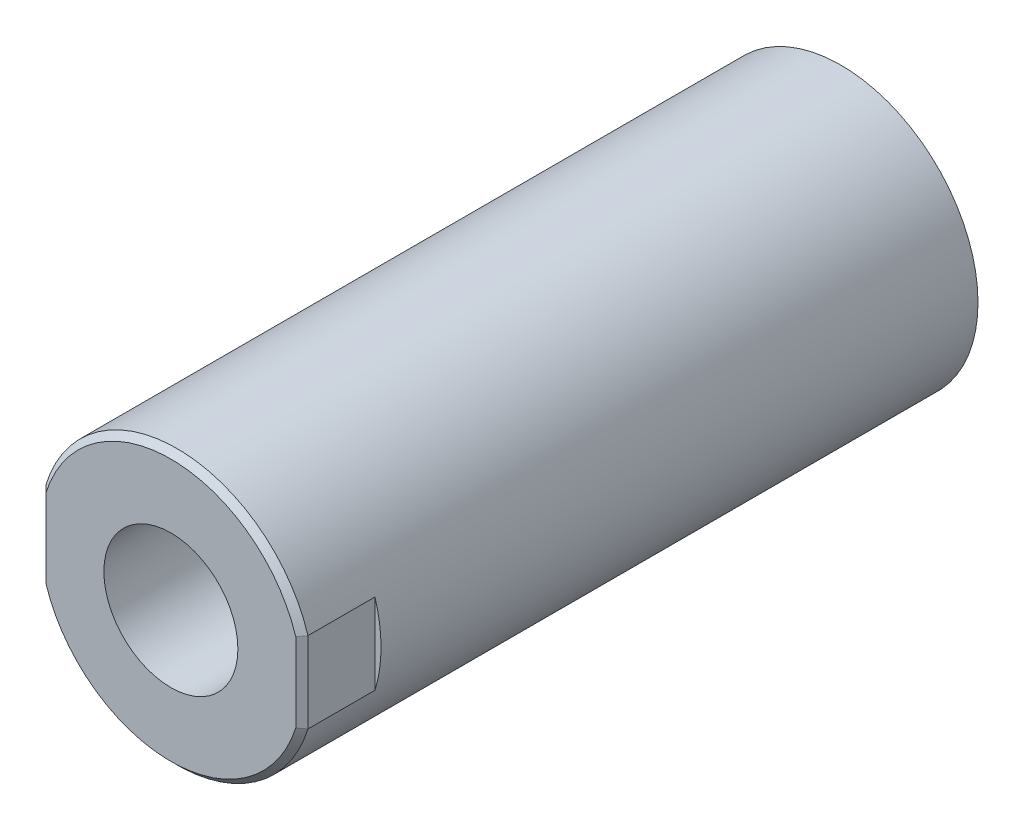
ISO-10303-21;
HEADER;
FILE_DESCRIPTION(('STEP AP214'),'2;1');
FILE_NAME('part.step','',(''),(''),'','','');
FILE_SCHEMA(('AUTOMOTIVE_DESIGN { 1 0 10303 214 1 1 1 1 }'));
ENDSEC;
DATA;
#1=APPLICATION_CONTEXT('core data for automotive mechanical design processes');
#2=APPLICATION_PROTOCOL_DEFINITION('international standard','automotive_design',2000,#1);
#3=PRODUCT_CONTEXT('',#1,'mechanical');
#4=PRODUCT('Part','Part','',(#3));
#5=PRODUCT_RELATED_PRODUCT_CATEGORY('part','',(#4));
#6=PRODUCT_DEFINITION_FORMATION('','',#4);
#7=PRODUCT_DEFINITION_CONTEXT('part definition',#1,'design');
#8=PRODUCT_DEFINITION('design','',#6,#7);
#9=PRODUCT_DEFINITION_SHAPE('','',#8);
#10=(LENGTH_UNIT() NAMED_UNIT(*) SI_UNIT(.MILLI.,.METRE.));
#11=(NAMED_UNIT(*) PLANE_ANGLE_UNIT() SI_UNIT($,.RADIAN.));
#12=(NAMED_UNIT(*) SI_UNIT($,.STERADIAN.) SOLID_ANGLE_UNIT());
#13=UNCERTAINTY_MEASURE_WITH_UNIT(LENGTH_MEASURE(1.E-05),#10,'distance_accuracy_value','');
#14=(GEOMETRIC_REPRESENTATION_CONTEXT(3) GLOBAL_UNCERTAINTY_ASSIGNED_CONTEXT((#13)) GLOBAL_UNIT_ASSIGNED_CONTEXT((#10,
#11,#12)) REPRESENTATION_CONTEXT('',''));
#15=CARTESIAN_POINT('',(0.,0.,0.));
#16=DIRECTION('',(0.,0.,1.));
#17=DIRECTION('',(1.,0.,0.));
#18=AXIS2_PLACEMENT_3D('',#15,#16,#17);
#19=CARTESIAN_POINT('',(0.,0.,-110.));
#20=DIRECTION('',(0.,0.,1.));
#21=DIRECTION('',(1.,0.,0.));
#22=AXIS2_PLACEMENT_3D('',#19,#20,#21);
#23=PLANE('',#22);
#24=CARTESIAN_POINT('',(0.,0.,-110.));
#25=DIRECTION('',(0.,0.,1.));
#26=DIRECTION('',(1.,0.,0.));
#27=AXIS2_PLACEMENT_3D('',#24,#25,#26);
#28=CIRCLE('',#27,22.5);
#29=CARTESIAN_POINT('',(22.5,0.,-110.));
#30=VERTEX_POINT('',#29);
#31=EDGE_CURVE('E210',#30,#30,#28,.T.);
#32=ORIENTED_EDGE('',*,*,#31,.F.);
#33=EDGE_LOOP('',(#32));
#34=FACE_BOUND('',#33,.T.);
#35=ADVANCED_FACE('F39',(#34),#23,.F.);
#36=CARTESIAN_POINT('',(21.5,-10.5,-12.));
#37=DIRECTION('',(0.,0.,-1.));
#38=DIRECTION('',(-1.,0.,0.));
#39=AXIS2_PLACEMENT_3D('',#36,#37,#38);
#40=PLANE('',#39);
#41=CARTESIAN_POINT('',(0.,0.,-12.));
#42=DIRECTION('',(0.,0.,-1.));
#43=DIRECTION('',(-1.,0.,0.));
#44=AXIS2_PLACEMENT_3D('',#41,#42,#43);
#45=CIRCLE('',#44,22.5);
#46=CARTESIAN_POINT('',(21.5,-6.63324958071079,-12.));
#47=VERTEX_POINT('',#46);
#48=CARTESIAN_POINT('',(21.5,6.63324958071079,-12.));
#49=VERTEX_POINT('',#48);
#50=EDGE_CURVE('E213',#47,#49,#45,.F.);
#51=ORIENTED_EDGE('',*,*,#50,.T.);
#52=DIRECTION('',(0.,1.,0.));
#53=VECTOR('',#52,1.);
#54=CARTESIAN_POINT('',(21.5,-10.5,-12.));
#55=LINE('',#54,#53);
#56=EDGE_CURVE('E113',#47,#49,#55,.T.);
#57=ORIENTED_EDGE('',*,*,#56,.F.);
#58=EDGE_LOOP('',(#51,#57));
#59=FACE_BOUND('',#58,.T.);
#60=ADVANCED_FACE('F170',(#59),#40,.F.);
#61=CARTESIAN_POINT('',(-24.,-10.5,-12.));
#62=DIRECTION('',(0.,0.,-1.));
#63=DIRECTION('',(-1.,0.,0.));
#64=AXIS2_PLACEMENT_3D('',#61,#62,#63);
#65=PLANE('',#64);
#66=CARTESIAN_POINT('',(0.,0.,-12.));
#67=DIRECTION('',(0.,0.,-1.));
#68=DIRECTION('',(-1.,0.,0.));
#69=AXIS2_PLACEMENT_3D('',#66,#67,#68);
#70=CIRCLE('',#69,22.5);
#71=CARTESIAN_POINT('',(-21.5,6.63324958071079,-12.));
#72=VERTEX_POINT('',#71);
#73=CARTESIAN_POINT('',(-21.5,-6.63324958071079,-12.));
#74=VERTEX_POINT('',#73);
#75=EDGE_CURVE('E108',#72,#74,#70,.F.);
#76=ORIENTED_EDGE('',*,*,#75,.T.);
#77=DIRECTION('',(0.,1.,0.));
#78=VECTOR('',#77,1.);
#79=CARTESIAN_POINT('',(-21.5,-10.5,-12.));
#80=LINE('',#79,#78);
#81=EDGE_CURVE('E103',#74,#72,#80,.T.);
#82=ORIENTED_EDGE('',*,*,#81,.T.);
#83=EDGE_LOOP('',(#76,#82));
#84=FACE_BOUND('',#83,.T.);
#85=ADVANCED_FACE('F111',(#84),#65,.F.);
#86=CARTESIAN_POINT('',(0.,0.,-110.));
#87=DIRECTION('',(0.,0.,1.));
#88=DIRECTION('',(1.,0.,0.));
#89=AXIS2_PLACEMENT_3D('',#86,#87,#88);
#90=CYLINDRICAL_SURFACE('',#89,22.5);
#91=DIRECTION('',(0.,0.,1.));
#92=VECTOR('',#91,1.);
#93=CARTESIAN_POINT('',(-21.5,6.63324958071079,-110.));
#94=LINE('',#93,#92);
#95=CARTESIAN_POINT('',(-21.5,6.63324958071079,-1.));
#96=VERTEX_POINT('',#95);
#97=EDGE_CURVE('E99',#96,#72,#94,.F.);
#98=ORIENTED_EDGE('',*,*,#97,.F.);
#99=CARTESIAN_POINT('',(0.,0.,-1.));
#100=DIRECTION('',(0.,0.,1.));
#101=DIRECTION('',(1.,0.,0.));
#102=AXIS2_PLACEMENT_3D('',#99,#100,#101);
#103=CIRCLE('',#102,22.5);
#104=CARTESIAN_POINT('',(21.5,6.63324958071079,-1.));
#105=VERTEX_POINT('',#104);
#106=EDGE_CURVE('E52',#96,#105,#103,.F.);
#107=ORIENTED_EDGE('',*,*,#106,.T.);
#108=DIRECTION('',(0.,0.,1.));
#109=VECTOR('',#108,1.);
#110=CARTESIAN_POINT('',(21.5,6.63324958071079,-110.));
#111=LINE('',#110,#109);
#112=EDGE_CURVE('E219',#49,#105,#111,.T.);
#113=ORIENTED_EDGE('',*,*,#112,.F.);
#114=ORIENTED_EDGE('',*,*,#50,.F.);
#115=DIRECTION('',(0.,0.,1.));
#116=VECTOR('',#115,1.);
#117=CARTESIAN_POINT('',(21.5,-6.63324958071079,-110.));
#118=LINE('',#117,#116);
#119=CARTESIAN_POINT('',(21.5,-6.63324958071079,-1.));
#120=VERTEX_POINT('',#119);
#121=EDGE_CURVE('E120',#120,#47,#118,.F.);
#122=ORIENTED_EDGE('',*,*,#121,.F.);
#123=CARTESIAN_POINT('',(0.,0.,-1.));
#124=DIRECTION('',(0.,0.,1.));
#125=DIRECTION('',(1.,0.,0.));
#126=AXIS2_PLACEMENT_3D('',#123,#124,#125);
#127=CIRCLE('',#126,22.5);
#128=CARTESIAN_POINT('',(-21.5,-6.63324958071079,-1.));
#129=VERTEX_POINT('',#128);
#130=EDGE_CURVE('E134',#120,#129,#127,.F.);
#131=ORIENTED_EDGE('',*,*,#130,.T.);
#132=DIRECTION('',(0.,0.,1.));
#133=VECTOR('',#132,1.);
#134=CARTESIAN_POINT('',(-21.5,-6.63324958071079,-110.));
#135=LINE('',#134,#133);
#136=EDGE_CURVE('E118',#74,#129,#135,.T.);
#137=ORIENTED_EDGE('',*,*,#136,.F.);
#138=ORIENTED_EDGE('',*,*,#75,.F.);
#139=EDGE_LOOP('',(#98,#107,#113,#114,#122,#131,#137,#138));
#140=FACE_BOUND('',#139,.T.);
#141=ORIENTED_EDGE('',*,*,#31,.T.);
#142=EDGE_LOOP('',(#141));
#143=FACE_BOUND('',#142,.T.);
#144=ADVANCED_FACE('F116',(#140,#143),#90,.T.);
#145=CARTESIAN_POINT('',(21.5,-10.5,0.));
#146=DIRECTION('',(-1.,0.,0.));
#147=DIRECTION('',(0.,0.,1.));
#148=AXIS2_PLACEMENT_3D('',#145,#146,#147);
#149=PLANE('',#148);
#150=ORIENTED_EDGE('',*,*,#112,.T.);
#151=DIRECTION('',(0.,-1.,0.));
#152=VECTOR('',#151,1.);
#153=CARTESIAN_POINT('',(21.5,-6.63324958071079,-1.));
#154=LINE('',#153,#152);
#155=EDGE_CURVE('E11',#105,#120,#154,.T.);
#156=ORIENTED_EDGE('',*,*,#155,.T.);
#157=ORIENTED_EDGE('',*,*,#121,.T.);
#158=ORIENTED_EDGE('',*,*,#56,.T.);
#159=EDGE_LOOP('',(#150,#156,#157,#158));
#160=FACE_BOUND('',#159,.T.);
#161=ADVANCED_FACE('F183',(#160),#149,.F.);
#162=CARTESIAN_POINT('',(-21.5,-10.5,0.));
#163=DIRECTION('',(1.,0.,0.));
#164=DIRECTION('',(0.,0.,-1.));
#165=AXIS2_PLACEMENT_3D('',#162,#163,#164);
#166=PLANE('',#165);
#167=ORIENTED_EDGE('',*,*,#136,.T.);
#168=DIRECTION('',(0.,1.,0.));
#169=VECTOR('',#168,1.);
#170=CARTESIAN_POINT('',(-21.5,6.63324958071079,-1.));
#171=LINE('',#170,#169);
#172=EDGE_CURVE('E106',#129,#96,#171,.T.);
#173=ORIENTED_EDGE('',*,*,#172,.T.);
#174=ORIENTED_EDGE('',*,*,#97,.T.);
#175=ORIENTED_EDGE('',*,*,#81,.F.);
#176=EDGE_LOOP('',(#167,#173,#174,#175));
#177=FACE_BOUND('',#176,.T.);
#178=ADVANCED_FACE('F102',(#177),#166,.F.);
#179=CARTESIAN_POINT('',(0.,0.,0.));
#180=DIRECTION('',(0.,0.,1.));
#181=DIRECTION('',(1.,0.,0.));
#182=AXIS2_PLACEMENT_3D('',#179,#180,#181);
#183=PLANE('',#182);
#184=CARTESIAN_POINT('',(0.,0.,0.));
#185=DIRECTION('',(0.,0.,1.));
#186=DIRECTION('',(1.,0.,0.));
#187=AXIS2_PLACEMENT_3D('',#184,#185,#186);
#188=CIRCLE('',#187,21.5);
#189=CARTESIAN_POINT('',(20.5,6.48074069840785,0.));
#190=VERTEX_POINT('',#189);
#191=CARTESIAN_POINT('',(-20.5,6.48074069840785,0.));
#192=VERTEX_POINT('',#191);
#193=EDGE_CURVE('E129',#190,#192,#188,.T.);
#194=ORIENTED_EDGE('',*,*,#193,.T.);
#195=DIRECTION('',(0.,-1.,0.));
#196=VECTOR('',#195,1.);
#197=CARTESIAN_POINT('',(-20.5,-6.63324958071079,0.));
#198=LINE('',#197,#196);
#199=CARTESIAN_POINT('',(-20.5,-6.48074069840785,0.));
#200=VERTEX_POINT('',#199);
#201=EDGE_CURVE('E131',#192,#200,#198,.T.);
#202=ORIENTED_EDGE('',*,*,#201,.T.);
#203=CARTESIAN_POINT('',(0.,0.,0.));
#204=DIRECTION('',(0.,0.,1.));
#205=DIRECTION('',(1.,0.,0.));
#206=AXIS2_PLACEMENT_3D('',#203,#204,#205);
#207=CIRCLE('',#206,21.5);
#208=CARTESIAN_POINT('',(20.5,-6.48074069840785,0.));
#209=VERTEX_POINT('',#208);
#210=EDGE_CURVE('E125',#200,#209,#207,.T.);
#211=ORIENTED_EDGE('',*,*,#210,.T.);
#212=DIRECTION('',(0.,1.,0.));
#213=VECTOR('',#212,1.);
#214=CARTESIAN_POINT('',(20.5,6.63324958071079,0.));
#215=LINE('',#214,#213);
#216=EDGE_CURVE('E127',#209,#190,#215,.T.);
#217=ORIENTED_EDGE('',*,*,#216,.T.);
#218=EDGE_LOOP('',(#194,#202,#211,#217));
#219=FACE_BOUND('',#218,.T.);
#220=CARTESIAN_POINT('',(0.,0.,0.));
#221=DIRECTION('',(0.,0.,-1.));
#222=DIRECTION('',(-1.,0.,0.));
#223=AXIS2_PLACEMENT_3D('',#220,#221,#222);
#224=CIRCLE('',#223,11.);
#225=CARTESIAN_POINT('',(-11.,0.,0.));
#226=VERTEX_POINT('',#225);
#227=EDGE_CURVE('E114',#226,#226,#224,.F.);
#228=ORIENTED_EDGE('',*,*,#227,.F.);
#229=EDGE_LOOP('',(#228));
#230=FACE_BOUND('',#229,.T.);
#231=ADVANCED_FACE('F195',(#219,#230),#183,.T.);
#232=CARTESIAN_POINT('',(0.,0.,15.));
#233=DIRECTION('',(0.,0.,1.));
#234=DIRECTION('',(1.,0.,0.));
#235=AXIS2_PLACEMENT_3D('',#232,#233,#234);
#236=CYLINDRICAL_SURFACE('',#235,11.);
#237=ORIENTED_EDGE('',*,*,#227,.T.);
#238=EDGE_LOOP('',(#237));
#239=FACE_BOUND('',#238,.T.);
#240=CARTESIAN_POINT('',(0.,0.,-39.));
#241=DIRECTION('',(0.,0.,1.));
#242=DIRECTION('',(1.,0.,0.));
#243=AXIS2_PLACEMENT_3D('',#240,#241,#242);
#244=CIRCLE('',#243,11.);
#245=CARTESIAN_POINT('',(11.,0.,-39.));
#246=VERTEX_POINT('',#245);
#247=EDGE_CURVE('E208',#246,#246,#244,.T.);
#248=ORIENTED_EDGE('',*,*,#247,.F.);
#249=EDGE_LOOP('',(#248));
#250=FACE_BOUND('',#249,.T.);
#251=ADVANCED_FACE('F180',(#239,#250),#236,.F.);
#252=CARTESIAN_POINT('',(0.,0.,-39.));
#253=DIRECTION('',(0.,0.,1.));
#254=DIRECTION('',(1.,0.,0.));
#255=AXIS2_PLACEMENT_3D('',#252,#253,#254);
#256=CONICAL_SURFACE('',#255,11.,1.02974425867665);
#257=CARTESIAN_POINT('',(0.,0.,-45.6094668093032));
#258=VERTEX_POINT('',#257);
#259=VERTEX_LOOP('',#258);
#260=FACE_BOUND('',#259,.T.);
#261=ORIENTED_EDGE('',*,*,#247,.T.);
#262=EDGE_LOOP('',(#261));
#263=FACE_BOUND('',#262,.T.);
#264=ADVANCED_FACE('F166',(#260,#263),#256,.F.);
#265=CARTESIAN_POINT('',(20.5,0.,0.));
#266=DIRECTION('',(0.70710678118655,0.,0.707106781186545));
#267=DIRECTION('',(0.707106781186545,0.,-0.70710678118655));
#268=AXIS2_PLACEMENT_3D('',#265,#266,#267);
#269=PLANE('',#268);
#270=CARTESIAN_POINT('',(21.5,6.63324958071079,-1.));
#271=CARTESIAN_POINT('',(21.33331105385,6.60812362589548,-0.833311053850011));
#272=CARTESIAN_POINT('',(21.1666332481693,6.58285157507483,-0.666633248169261));
#273=CARTESIAN_POINT('',(20.8332999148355,6.53201528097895,-0.333299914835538));
#274=CARTESIAN_POINT('',(20.666644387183,6.50645103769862,-0.166644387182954));
#275=CARTESIAN_POINT('',(20.5,6.48074069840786,0.));
#276=B_SPLINE_CURVE_WITH_KNOTS('',3,(#270,#271,#272,#273,#274,#275),.UNSPECIFIED.,.F.,.F.,(4,2,
4),(0.,0.711206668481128,1.42241334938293),.UNSPECIFIED.);
#277=EDGE_CURVE('E226',#190,#105,#276,.F.);
#278=ORIENTED_EDGE('',*,*,#277,.F.);
#279=ORIENTED_EDGE('',*,*,#216,.F.);
#280=CARTESIAN_POINT('',(21.5,-6.63324958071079,-1.));
#281=CARTESIAN_POINT('',(21.33331105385,-6.60812362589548,-0.833311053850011));
#282=CARTESIAN_POINT('',(21.1666332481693,-6.58285157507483,-0.666633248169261));
#283=CARTESIAN_POINT('',(20.8332999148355,-6.53201528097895,-0.333299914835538));
#284=CARTESIAN_POINT('',(20.666644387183,-6.50645103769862,-0.166644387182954));
#285=CARTESIAN_POINT('',(20.5,-6.48074069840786,0.));
#286=B_SPLINE_CURVE_WITH_KNOTS('',3,(#280,#281,#282,#283,#284,#285),.UNSPECIFIED.,.F.,.F.,(4,2,
4),(0.,0.711206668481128,1.42241334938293),.UNSPECIFIED.);
#287=EDGE_CURVE('E44',#120,#209,#286,.T.);
#288=ORIENTED_EDGE('',*,*,#287,.F.);
#289=ORIENTED_EDGE('',*,*,#155,.F.);
#290=EDGE_LOOP('',(#278,#279,#288,#289));
#291=FACE_BOUND('',#290,.T.);
#292=ADVANCED_FACE('F41',(#291),#269,.T.);
#293=CARTESIAN_POINT('',(0.,0.,0.));
#294=DIRECTION('',(0.,0.,-1.));
#295=DIRECTION('',(-1.,0.,0.));
#296=AXIS2_PLACEMENT_3D('',#293,#294,#295);
#297=CONICAL_SURFACE('',#296,21.5,0.785398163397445);
#298=ORIENTED_EDGE('',*,*,#287,.T.);
#299=ORIENTED_EDGE('',*,*,#210,.F.);
#300=CARTESIAN_POINT('',(-20.5,-6.48074069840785,0.));
#301=CARTESIAN_POINT('',(-20.666644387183,-6.50645103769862,-0.166644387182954));
#302=CARTESIAN_POINT('',(-20.8332999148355,-6.53201528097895,-0.333299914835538));
#303=CARTESIAN_POINT('',(-21.1666332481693,-6.58285157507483,-0.666633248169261));
#304=CARTESIAN_POINT('',(-21.33331105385,-6.60812362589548,-0.83331105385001));
#305=CARTESIAN_POINT('',(-21.5,-6.6332495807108,-1.));
#306=B_SPLINE_CURVE_WITH_KNOTS('',3,(#300,#301,#302,#303,#304,#305),.UNSPECIFIED.,.F.,.F.,(4,2,
4),(0.,0.711206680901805,1.42241334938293),.UNSPECIFIED.);
#307=EDGE_CURVE('E144',#129,#200,#306,.F.);
#308=ORIENTED_EDGE('',*,*,#307,.F.);
#309=ORIENTED_EDGE('',*,*,#130,.F.);
#310=EDGE_LOOP('',(#298,#299,#308,#309));
#311=FACE_BOUND('',#310,.T.);
#312=ADVANCED_FACE('F155',(#311),#297,.T.);
#313=CARTESIAN_POINT('',(0.,0.,0.));
#314=DIRECTION('',(0.,0.,-1.));
#315=DIRECTION('',(-1.,0.,0.));
#316=AXIS2_PLACEMENT_3D('',#313,#314,#315);
#317=CONICAL_SURFACE('',#316,21.5,0.785398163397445);
#318=ORIENTED_EDGE('',*,*,#277,.T.);
#319=ORIENTED_EDGE('',*,*,#106,.F.);
#320=CARTESIAN_POINT('',(-21.5,6.63324958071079,-1.));
#321=CARTESIAN_POINT('',(-21.33331105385,6.60812362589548,-0.833311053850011));
#322=CARTESIAN_POINT('',(-21.1666332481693,6.58285157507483,-0.666633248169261));
#323=CARTESIAN_POINT('',(-20.8332999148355,6.53201528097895,-0.333299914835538));
#324=CARTESIAN_POINT('',(-20.666644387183,6.50645103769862,-0.166644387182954));
#325=CARTESIAN_POINT('',(-20.5,6.48074069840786,0.));
#326=B_SPLINE_CURVE_WITH_KNOTS('',3,(#320,#321,#322,#323,#324,#325),.UNSPECIFIED.,.F.,.F.,(4,2,
4),(0.,0.711206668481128,1.42241334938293),.UNSPECIFIED.);
#327=EDGE_CURVE('E137',#192,#96,#326,.F.);
#328=ORIENTED_EDGE('',*,*,#327,.F.);
#329=ORIENTED_EDGE('',*,*,#193,.F.);
#330=EDGE_LOOP('',(#318,#319,#328,#329));
#331=FACE_BOUND('',#330,.T.);
#332=ADVANCED_FACE('F148',(#331),#317,.T.);
#333=CARTESIAN_POINT('',(-21.5,-10.5,-1.));
#334=DIRECTION('',(-0.70710678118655,0.,0.707106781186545));
#335=DIRECTION('',(0.707106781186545,0.,0.70710678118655));
#336=AXIS2_PLACEMENT_3D('',#333,#334,#335);
#337=PLANE('',#336);
#338=ORIENTED_EDGE('',*,*,#307,.T.);
#339=ORIENTED_EDGE('',*,*,#201,.F.);
#340=ORIENTED_EDGE('',*,*,#327,.T.);
#341=ORIENTED_EDGE('',*,*,#172,.F.);
#342=EDGE_LOOP('',(#338,#339,#340,#341));
#343=FACE_BOUND('',#342,.T.);
#344=ADVANCED_FACE('F151',(#343),#337,.T.);
#345=CLOSED_SHELL('',(#35,#60,#85,#144,#161,#178,#231,#251,#264,#292,#312,#332,#344));
#346=MANIFOLD_SOLID_BREP('B2',#345);
#347=ADVANCED_BREP_SHAPE_REPRESENTATION('',(#18,#346),#14);
#348=SHAPE_DEFINITION_REPRESENTATION(#9,#347);
ENDSEC;
END-ISO-10303-21;
